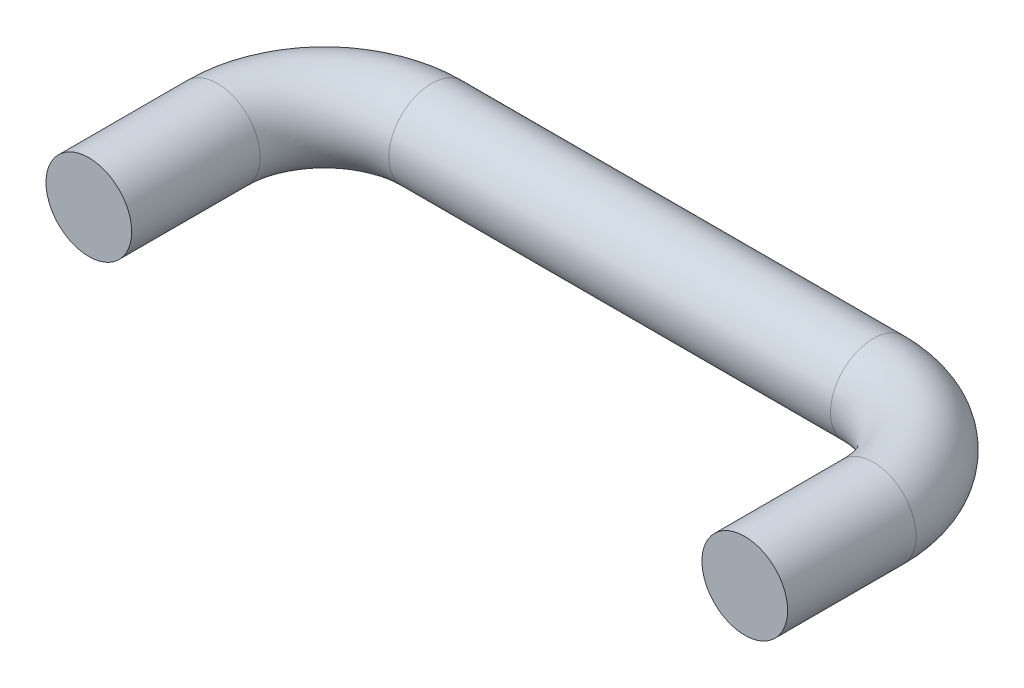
from build123d import *

# Parameters (mm, degrees)
SKETCH1_R             = 0.508
BOSS_EXTRUDE1_DEPTH   = 1.524
BOSS_EXTRUDE1_2_DEPTH = 1.524
SKETCH2_R             = 0.508
REVOLVE1_ANGLE        = 90
SKETCH3_R             = 0.508
REVOLVE2_ANGLE        = 90
BOSS_EXTRUDE2_REACH   = 9.257
SKETCH4_R             = 0.508


with BuildPart() as part:
    # Sketch1 → Boss-Extrude1 (new body)
    with BuildSketch(Plane.XY):
        with Locations((3.8895, 0)):
            Circle(SKETCH1_R)
    extrude(amount=BOSS_EXTRUDE1_DEPTH)

    # Sketch2 → Revolve1 (revolve)
    with BuildSketch(Plane(origin=(0, 0, 0), x_dir=(-1, 0, 0), z_dir=(0, 0, -1))):
        with Locations(Location((-3.8895, 0, 0), (0, 0, 180))):
            Circle(SKETCH2_R)
    revolve(axis=Axis((2.6195, 1.878339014, 0), (0, 1, 0)), revolution_arc=REVOLVE1_ANGLE)


with BuildPart() as body_2:
    # Sketch1 → Boss-Extrude1 2 (new body)
    with BuildSketch(Plane.XY):
        with Locations((-3.8895, 0)):
            Circle(SKETCH1_R)
    extrude(amount=BOSS_EXTRUDE1_2_DEPTH)

    # Sketch3 → Revolve2 (revolve)
    with BuildSketch(Plane(origin=(0, 0, 0), x_dir=(-1, 0, 0), z_dir=(0, 0, -1))):
        with Locations((3.8895, 0)):
            Circle(SKETCH3_R)
    revolve(axis=Axis((-2.6195, 2.086823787, 0), (0, -1, 0)), revolution_arc=REVOLVE2_ANGLE)

    # Sketch4 → Boss-Extrude2 (add, up to next)
    with BuildSketch(Plane.ZY.offset(-2.6195), mode=Mode.PRIVATE) as boss_extrude2_sk1:
        with Locations(Location((-1.27, 0, 0), (0, 0, 179.99999999))):
            Circle(SKETCH4_R)
    boss_extrude2_tool1 = extrude(boss_extrude2_sk1.sketch, amount=BOSS_EXTRUDE2_REACH, mode=Mode.PRIVATE) - body_2.part

    add(part.part)  # Boss-Extrude2 merges part
    add(boss_extrude2_tool1.solids().sort_by_distance((2.6195, 0, -1.27))[0])


solid = body_2.part
